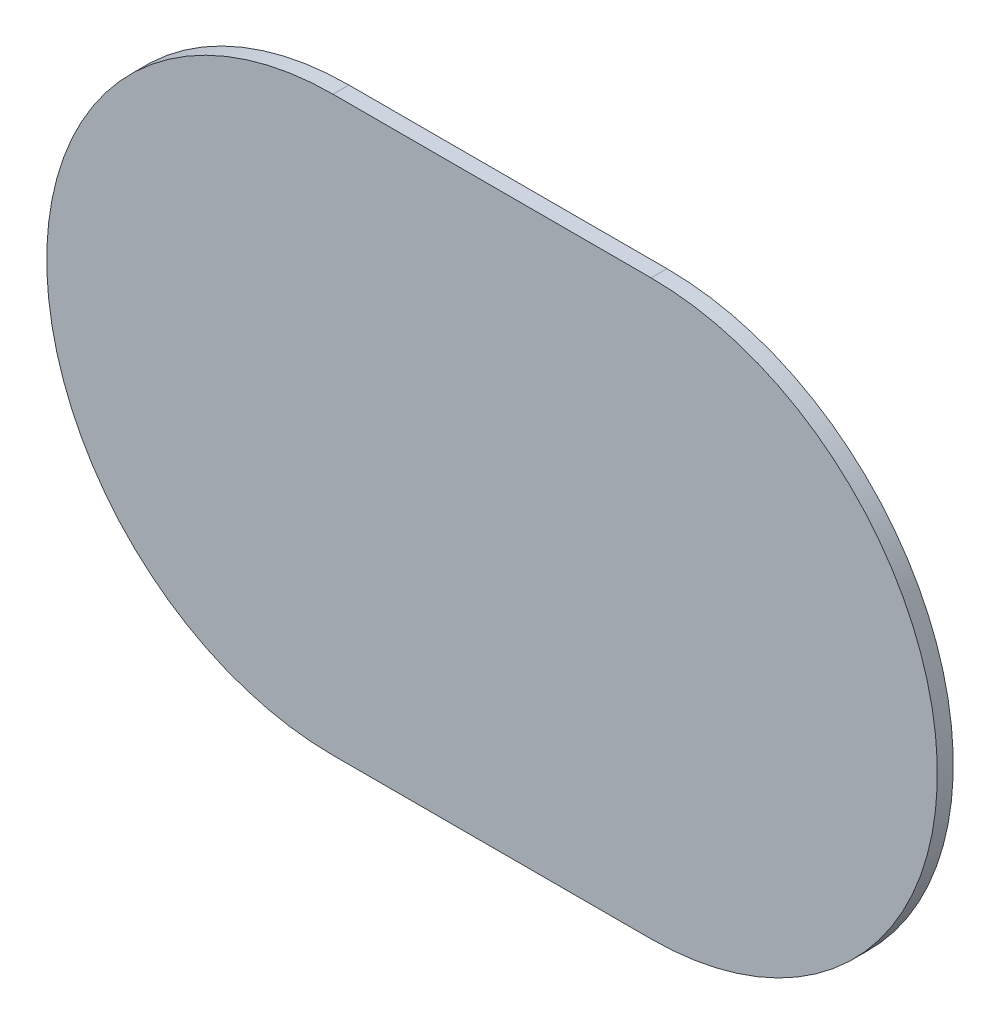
ISO-10303-21;
HEADER;
FILE_DESCRIPTION(('STEP AP214'),'2;1');
FILE_NAME('part.step','',(''),(''),'','','');
FILE_SCHEMA(('AUTOMOTIVE_DESIGN { 1 0 10303 214 1 1 1 1 }'));
ENDSEC;
DATA;
#1=APPLICATION_CONTEXT('core data for automotive mechanical design processes');
#2=APPLICATION_PROTOCOL_DEFINITION('international standard','automotive_design',2000,#1);
#3=PRODUCT_CONTEXT('',#1,'mechanical');
#4=PRODUCT('Part','Part','',(#3));
#5=PRODUCT_RELATED_PRODUCT_CATEGORY('part','',(#4));
#6=PRODUCT_DEFINITION_FORMATION('','',#4);
#7=PRODUCT_DEFINITION_CONTEXT('part definition',#1,'design');
#8=PRODUCT_DEFINITION('design','',#6,#7);
#9=PRODUCT_DEFINITION_SHAPE('','',#8);
#10=(LENGTH_UNIT() NAMED_UNIT(*) SI_UNIT(.MILLI.,.METRE.));
#11=(NAMED_UNIT(*) PLANE_ANGLE_UNIT() SI_UNIT($,.RADIAN.));
#12=(NAMED_UNIT(*) SI_UNIT($,.STERADIAN.) SOLID_ANGLE_UNIT());
#13=UNCERTAINTY_MEASURE_WITH_UNIT(LENGTH_MEASURE(1.E-05),#10,'distance_accuracy_value','');
#14=(GEOMETRIC_REPRESENTATION_CONTEXT(3) GLOBAL_UNCERTAINTY_ASSIGNED_CONTEXT((#13)) GLOBAL_UNIT_ASSIGNED_CONTEXT((#10,
#11,#12)) REPRESENTATION_CONTEXT('',''));
#15=CARTESIAN_POINT('',(0.,0.,0.));
#16=DIRECTION('',(0.,0.,1.));
#17=DIRECTION('',(1.,0.,0.));
#18=AXIS2_PLACEMENT_3D('',#15,#16,#17);
#19=CARTESIAN_POINT('',(0.,0.,0.5));
#20=DIRECTION('',(0.,0.,-1.));
#21=DIRECTION('',(-1.,0.,0.));
#22=AXIS2_PLACEMENT_3D('',#19,#20,#21);
#23=CYLINDRICAL_SURFACE('',#22,9.);
#24=CARTESIAN_POINT('',(0.,0.,0.));
#25=DIRECTION('',(0.,0.,1.));
#26=DIRECTION('',(1.,0.,0.));
#27=AXIS2_PLACEMENT_3D('',#24,#25,#26);
#28=CIRCLE('',#27,9.);
#29=CARTESIAN_POINT('',(0.,9.,0.));
#30=VERTEX_POINT('',#29);
#31=CARTESIAN_POINT('',(0.,-9.,0.));
#32=VERTEX_POINT('',#31);
#33=EDGE_CURVE('E113',#30,#32,#28,.T.);
#34=ORIENTED_EDGE('',*,*,#33,.T.);
#35=DIRECTION('',(0.,0.,-1.));
#36=VECTOR('',#35,1.);
#37=CARTESIAN_POINT('',(0.,-9.,0.5));
#38=LINE('',#37,#36);
#39=CARTESIAN_POINT('',(0.,-9.,0.5));
#40=VERTEX_POINT('',#39);
#41=EDGE_CURVE('E11',#40,#32,#38,.T.);
#42=ORIENTED_EDGE('',*,*,#41,.F.);
#43=CARTESIAN_POINT('',(0.,0.,0.5));
#44=DIRECTION('',(0.,0.,1.));
#45=DIRECTION('',(1.,0.,0.));
#46=AXIS2_PLACEMENT_3D('',#43,#44,#45);
#47=CIRCLE('',#46,9.);
#48=CARTESIAN_POINT('',(0.,9.,0.5));
#49=VERTEX_POINT('',#48);
#50=EDGE_CURVE('E97',#49,#40,#47,.T.);
#51=ORIENTED_EDGE('',*,*,#50,.F.);
#52=DIRECTION('',(0.,0.,-1.));
#53=VECTOR('',#52,1.);
#54=CARTESIAN_POINT('',(0.,9.,0.5));
#55=LINE('',#54,#53);
#56=EDGE_CURVE('E109',#49,#30,#55,.T.);
#57=ORIENTED_EDGE('',*,*,#56,.T.);
#58=EDGE_LOOP('',(#34,#42,#51,#57));
#59=FACE_BOUND('',#58,.T.);
#60=ADVANCED_FACE('F45',(#59),#23,.T.);
#61=CARTESIAN_POINT('',(0.,-9.,0.5));
#62=DIRECTION('',(0.,1.,0.));
#63=DIRECTION('',(0.,0.,1.));
#64=AXIS2_PLACEMENT_3D('',#61,#62,#63);
#65=PLANE('',#64);
#66=DIRECTION('',(1.,0.,0.));
#67=VECTOR('',#66,1.);
#68=CARTESIAN_POINT('',(0.,-9.,0.));
#69=LINE('',#68,#67);
#70=CARTESIAN_POINT('',(10.,-9.,0.));
#71=VERTEX_POINT('',#70);
#72=EDGE_CURVE('E102',#32,#71,#69,.T.);
#73=ORIENTED_EDGE('',*,*,#72,.T.);
#74=DIRECTION('',(0.,0.,-1.));
#75=VECTOR('',#74,1.);
#76=CARTESIAN_POINT('',(10.,-9.,0.5));
#77=LINE('',#76,#75);
#78=CARTESIAN_POINT('',(10.,-9.,0.5));
#79=VERTEX_POINT('',#78);
#80=EDGE_CURVE('E54',#79,#71,#77,.T.);
#81=ORIENTED_EDGE('',*,*,#80,.F.);
#82=DIRECTION('',(1.,0.,0.));
#83=VECTOR('',#82,1.);
#84=CARTESIAN_POINT('',(0.,-9.,0.5));
#85=LINE('',#84,#83);
#86=EDGE_CURVE('E92',#40,#79,#85,.T.);
#87=ORIENTED_EDGE('',*,*,#86,.F.);
#88=ORIENTED_EDGE('',*,*,#41,.T.);
#89=EDGE_LOOP('',(#73,#81,#87,#88));
#90=FACE_BOUND('',#89,.T.);
#91=ADVANCED_FACE('F101',(#90),#65,.F.);
#92=CARTESIAN_POINT('',(10.,0.,0.5));
#93=DIRECTION('',(0.,0.,-1.));
#94=DIRECTION('',(-1.,0.,0.));
#95=AXIS2_PLACEMENT_3D('',#92,#93,#94);
#96=CYLINDRICAL_SURFACE('',#95,9.);
#97=CARTESIAN_POINT('',(10.,0.,0.));
#98=DIRECTION('',(0.,0.,1.));
#99=DIRECTION('',(1.,0.,0.));
#100=AXIS2_PLACEMENT_3D('',#97,#98,#99);
#101=CIRCLE('',#100,9.);
#102=CARTESIAN_POINT('',(10.,9.,0.));
#103=VERTEX_POINT('',#102);
#104=EDGE_CURVE('E79',#71,#103,#101,.T.);
#105=ORIENTED_EDGE('',*,*,#104,.T.);
#106=DIRECTION('',(0.,0.,-1.));
#107=VECTOR('',#106,1.);
#108=CARTESIAN_POINT('',(10.,9.,0.5));
#109=LINE('',#108,#107);
#110=CARTESIAN_POINT('',(10.,9.,0.5));
#111=VERTEX_POINT('',#110);
#112=EDGE_CURVE('E104',#111,#103,#109,.T.);
#113=ORIENTED_EDGE('',*,*,#112,.F.);
#114=CARTESIAN_POINT('',(10.,0.,0.5));
#115=DIRECTION('',(0.,0.,1.));
#116=DIRECTION('',(1.,0.,0.));
#117=AXIS2_PLACEMENT_3D('',#114,#115,#116);
#118=CIRCLE('',#117,9.);
#119=EDGE_CURVE('E95',#79,#111,#118,.T.);
#120=ORIENTED_EDGE('',*,*,#119,.F.);
#121=ORIENTED_EDGE('',*,*,#80,.T.);
#122=EDGE_LOOP('',(#105,#113,#120,#121));
#123=FACE_BOUND('',#122,.T.);
#124=ADVANCED_FACE('F105',(#123),#96,.T.);
#125=CARTESIAN_POINT('',(0.,9.,0.5));
#126=DIRECTION('',(0.,-1.,0.));
#127=DIRECTION('',(0.,0.,-1.));
#128=AXIS2_PLACEMENT_3D('',#125,#126,#127);
#129=PLANE('',#128);
#130=DIRECTION('',(-1.,0.,0.));
#131=VECTOR('',#130,1.);
#132=CARTESIAN_POINT('',(0.,9.,0.));
#133=LINE('',#132,#131);
#134=EDGE_CURVE('E85',#103,#30,#133,.T.);
#135=ORIENTED_EDGE('',*,*,#134,.T.);
#136=ORIENTED_EDGE('',*,*,#56,.F.);
#137=DIRECTION('',(-1.,0.,0.));
#138=VECTOR('',#137,1.);
#139=CARTESIAN_POINT('',(0.,9.,0.5));
#140=LINE('',#139,#138);
#141=EDGE_CURVE('E62',#111,#49,#140,.T.);
#142=ORIENTED_EDGE('',*,*,#141,.F.);
#143=ORIENTED_EDGE('',*,*,#112,.T.);
#144=EDGE_LOOP('',(#135,#136,#142,#143));
#145=FACE_BOUND('',#144,.T.);
#146=ADVANCED_FACE('F126',(#145),#129,.F.);
#147=CARTESIAN_POINT('',(0.,0.,0.5));
#148=DIRECTION('',(0.,0.,1.));
#149=DIRECTION('',(1.,0.,0.));
#150=AXIS2_PLACEMENT_3D('',#147,#148,#149);
#151=PLANE('',#150);
#152=ORIENTED_EDGE('',*,*,#50,.T.);
#153=ORIENTED_EDGE('',*,*,#86,.T.);
#154=ORIENTED_EDGE('',*,*,#119,.T.);
#155=ORIENTED_EDGE('',*,*,#141,.T.);
#156=EDGE_LOOP('',(#152,#153,#154,#155));
#157=FACE_BOUND('',#156,.T.);
#158=ADVANCED_FACE('F93',(#157),#151,.T.);
#159=CARTESIAN_POINT('',(0.,0.,0.));
#160=DIRECTION('',(0.,0.,1.));
#161=DIRECTION('',(1.,0.,0.));
#162=AXIS2_PLACEMENT_3D('',#159,#160,#161);
#163=PLANE('',#162);
#164=ORIENTED_EDGE('',*,*,#33,.F.);
#165=ORIENTED_EDGE('',*,*,#134,.F.);
#166=ORIENTED_EDGE('',*,*,#104,.F.);
#167=ORIENTED_EDGE('',*,*,#72,.F.);
#168=EDGE_LOOP('',(#164,#165,#166,#167));
#169=FACE_BOUND('',#168,.T.);
#170=ADVANCED_FACE('F129',(#169),#163,.F.);
#171=CLOSED_SHELL('',(#60,#91,#124,#146,#158,#170));
#172=MANIFOLD_SOLID_BREP('B2',#171);
#173=ADVANCED_BREP_SHAPE_REPRESENTATION('',(#18,#172),#14);
#174=SHAPE_DEFINITION_REPRESENTATION(#9,#173);
ENDSEC;
END-ISO-10303-21;
